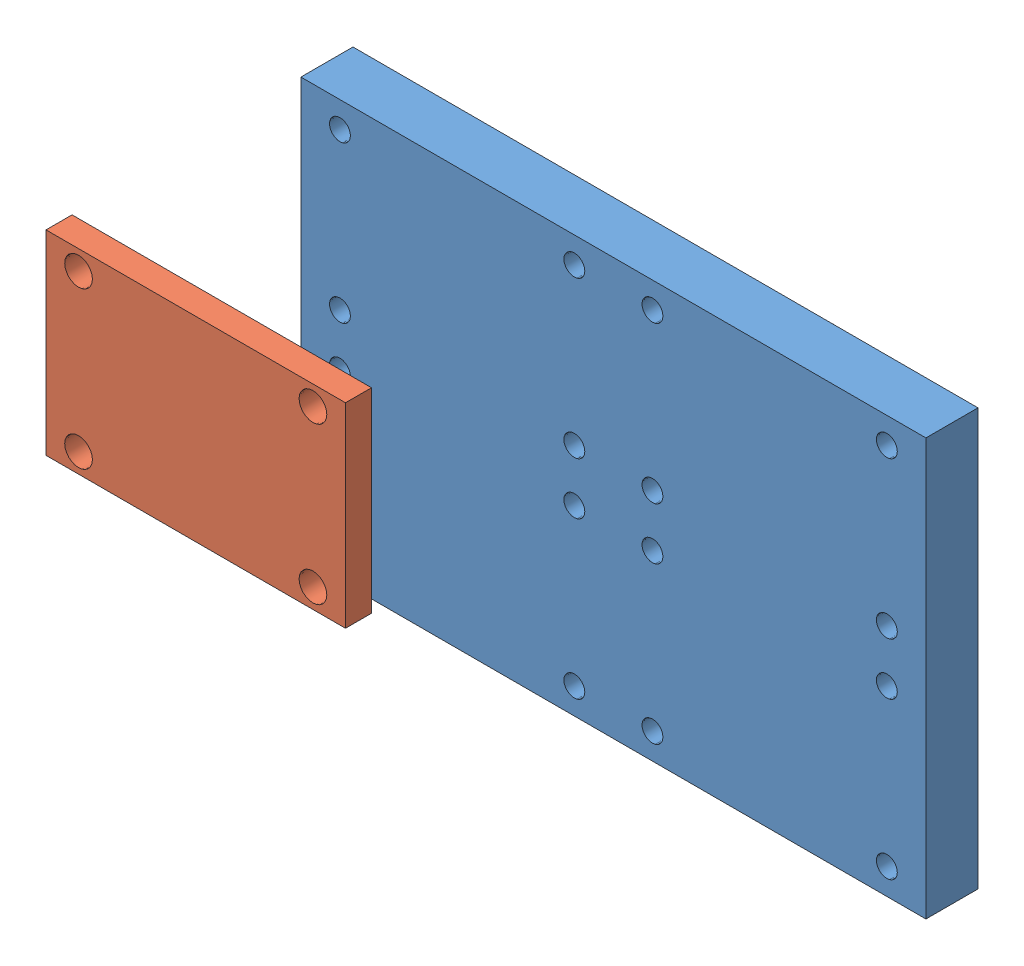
SolidWorks assembly SmartMatesExample.SLDASM, configuration Default (file format 4400). Lengths in mm.
Overall size (178.87 101.6 48.38).
2 component instances, 2 part files, 0 mates.
Components (placement in the parent):
- MatesBase-1: MatesBase.SLDPRT [Default] at origin size (152.4 101.6 12.7)
- MatesPlate-1: MatesPlate.SLDPRT [Default] at (-26.4675 26.313 42.0331) size (73.03 47.62 6.35)
